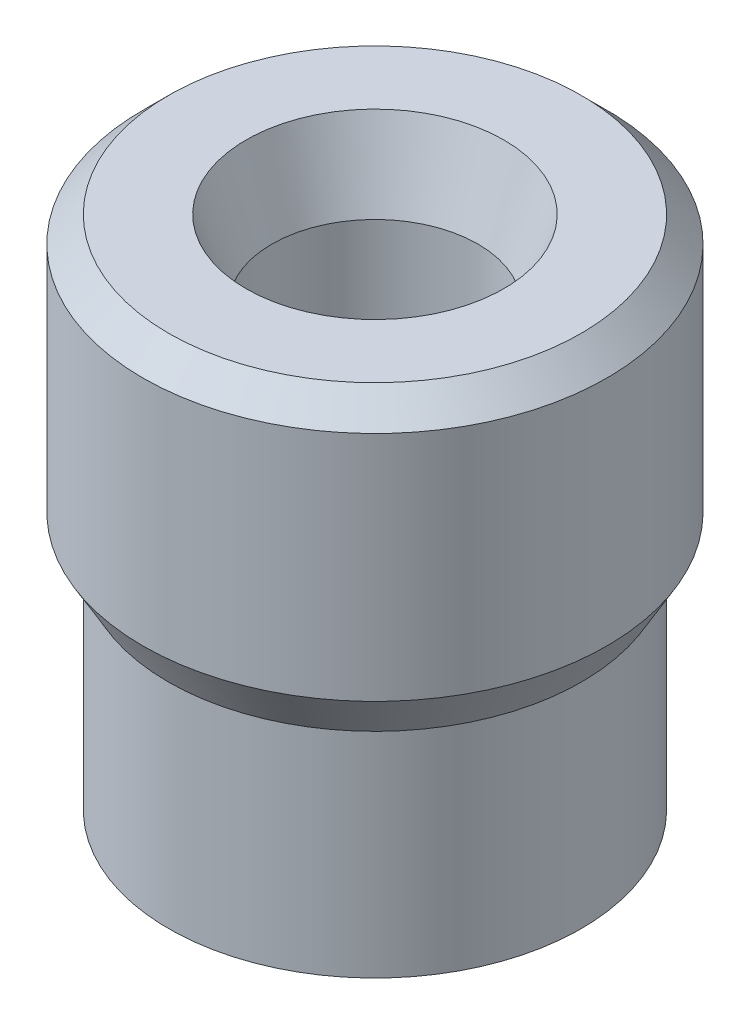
ISO-10303-21;
HEADER;
FILE_DESCRIPTION(('STEP AP214'),'2;1');
FILE_NAME('part.step','',(''),(''),'','','');
FILE_SCHEMA(('AUTOMOTIVE_DESIGN { 1 0 10303 214 1 1 1 1 }'));
ENDSEC;
DATA;
#1=APPLICATION_CONTEXT('core data for automotive mechanical design processes');
#2=APPLICATION_PROTOCOL_DEFINITION('international standard','automotive_design',2000,#1);
#3=PRODUCT_CONTEXT('',#1,'mechanical');
#4=PRODUCT('Part','Part','',(#3));
#5=PRODUCT_RELATED_PRODUCT_CATEGORY('part','',(#4));
#6=PRODUCT_DEFINITION_FORMATION('','',#4);
#7=PRODUCT_DEFINITION_CONTEXT('part definition',#1,'design');
#8=PRODUCT_DEFINITION('design','',#6,#7);
#9=PRODUCT_DEFINITION_SHAPE('','',#8);
#10=(LENGTH_UNIT() NAMED_UNIT(*) SI_UNIT(.MILLI.,.METRE.));
#11=(NAMED_UNIT(*) PLANE_ANGLE_UNIT() SI_UNIT($,.RADIAN.));
#12=(NAMED_UNIT(*) SI_UNIT($,.STERADIAN.) SOLID_ANGLE_UNIT());
#13=UNCERTAINTY_MEASURE_WITH_UNIT(LENGTH_MEASURE(1.E-05),#10,'distance_accuracy_value','');
#14=(GEOMETRIC_REPRESENTATION_CONTEXT(3) GLOBAL_UNCERTAINTY_ASSIGNED_CONTEXT((#13)) GLOBAL_UNIT_ASSIGNED_CONTEXT((#10,
#11,#12)) REPRESENTATION_CONTEXT('',''));
#15=CARTESIAN_POINT('',(0.,0.,0.));
#16=DIRECTION('',(0.,0.,1.));
#17=DIRECTION('',(1.,0.,0.));
#18=AXIS2_PLACEMENT_3D('',#15,#16,#17);
#19=CARTESIAN_POINT('',(0.,8.3,0.));
#20=DIRECTION('',(0.,-1.,0.));
#21=DIRECTION('',(0.,0.,-1.));
#22=AXIS2_PLACEMENT_3D('',#19,#20,#21);
#23=CYLINDRICAL_SURFACE('',#22,8.);
#24=CARTESIAN_POINT('',(0.,8.3,0.));
#25=DIRECTION('',(0.,1.,0.));
#26=DIRECTION('',(0.,0.,1.));
#27=AXIS2_PLACEMENT_3D('',#24,#25,#26);
#28=CIRCLE('',#27,8.);
#29=CARTESIAN_POINT('',(0.,8.3,-8.));
#30=VERTEX_POINT('',#29);
#31=EDGE_CURVE('E59',#30,#30,#28,.T.);
#32=CARTESIAN_POINT('',(0.,0.,0.));
#33=DIRECTION('',(0.,1.,0.));
#34=DIRECTION('',(0.,0.,1.));
#35=AXIS2_PLACEMENT_3D('',#32,#33,#34);
#36=CIRCLE('',#35,8.);
#37=CARTESIAN_POINT('',(0.,0.,-8.));
#38=VERTEX_POINT('',#37);
#39=EDGE_CURVE('E60',#38,#38,#36,.T.);
#40=CARTESIAN_POINT('',(0.,8.3,-8.));
#41=CARTESIAN_POINT('',(0.,8.21354166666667,-8.));
#42=CARTESIAN_POINT('',(0.,8.12708333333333,-8.));
#43=CARTESIAN_POINT('',(0.,7.95416666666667,-8.));
#44=CARTESIAN_POINT('',(0.,7.86770833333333,-8.));
#45=CARTESIAN_POINT('',(0.,7.69479166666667,-8.));
#46=CARTESIAN_POINT('',(0.,7.60833333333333,-8.));
#47=CARTESIAN_POINT('',(0.,7.43541666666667,-8.));
#48=CARTESIAN_POINT('',(0.,7.34895833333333,-8.));
#49=CARTESIAN_POINT('',(0.,7.17604166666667,-8.));
#50=CARTESIAN_POINT('',(0.,7.08958333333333,-8.));
#51=CARTESIAN_POINT('',(0.,6.91666666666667,-8.));
#52=CARTESIAN_POINT('',(0.,6.83020833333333,-8.));
#53=CARTESIAN_POINT('',(0.,6.65729166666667,-8.));
#54=CARTESIAN_POINT('',(0.,6.57083333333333,-8.));
#55=CARTESIAN_POINT('',(0.,6.39791666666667,-8.));
#56=CARTESIAN_POINT('',(0.,6.31145833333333,-8.));
#57=CARTESIAN_POINT('',(0.,6.13854166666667,-8.));
#58=CARTESIAN_POINT('',(0.,6.05208333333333,-8.));
#59=CARTESIAN_POINT('',(0.,5.87916666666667,-8.));
#60=CARTESIAN_POINT('',(0.,5.79270833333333,-8.));
#61=CARTESIAN_POINT('',(0.,5.61979166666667,-8.));
#62=CARTESIAN_POINT('',(0.,5.53333333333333,-8.));
#63=CARTESIAN_POINT('',(0.,5.36041666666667,-8.));
#64=CARTESIAN_POINT('',(0.,5.27395833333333,-8.));
#65=CARTESIAN_POINT('',(0.,5.10104166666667,-8.));
#66=CARTESIAN_POINT('',(0.,5.01458333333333,-8.));
#67=CARTESIAN_POINT('',(0.,4.84166666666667,-8.));
#68=CARTESIAN_POINT('',(0.,4.75520833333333,-8.));
#69=CARTESIAN_POINT('',(0.,4.58229166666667,-8.));
#70=CARTESIAN_POINT('',(0.,4.49583333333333,-8.));
#71=CARTESIAN_POINT('',(0.,4.32291666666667,-8.));
#72=CARTESIAN_POINT('',(0.,4.23645833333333,-8.));
#73=CARTESIAN_POINT('',(0.,4.06354166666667,-8.));
#74=CARTESIAN_POINT('',(0.,3.97708333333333,-8.));
#75=CARTESIAN_POINT('',(0.,3.80416666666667,-8.));
#76=CARTESIAN_POINT('',(0.,3.71770833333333,-8.));
#77=CARTESIAN_POINT('',(0.,3.54479166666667,-8.));
#78=CARTESIAN_POINT('',(0.,3.45833333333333,-8.));
#79=CARTESIAN_POINT('',(0.,3.28541666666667,-8.));
#80=CARTESIAN_POINT('',(0.,3.19895833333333,-8.));
#81=CARTESIAN_POINT('',(0.,3.02604166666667,-8.));
#82=CARTESIAN_POINT('',(0.,2.93958333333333,-8.));
#83=CARTESIAN_POINT('',(0.,2.76666666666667,-8.));
#84=CARTESIAN_POINT('',(0.,2.68020833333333,-8.));
#85=CARTESIAN_POINT('',(0.,2.50729166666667,-8.));
#86=CARTESIAN_POINT('',(0.,2.42083333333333,-8.));
#87=CARTESIAN_POINT('',(0.,2.24791666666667,-8.));
#88=CARTESIAN_POINT('',(0.,2.16145833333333,-8.));
#89=CARTESIAN_POINT('',(0.,1.98854166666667,-8.));
#90=CARTESIAN_POINT('',(0.,1.90208333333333,-8.));
#91=CARTESIAN_POINT('',(0.,1.72916666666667,-8.));
#92=CARTESIAN_POINT('',(0.,1.64270833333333,-8.));
#93=CARTESIAN_POINT('',(0.,1.46979166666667,-8.));
#94=CARTESIAN_POINT('',(0.,1.38333333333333,-8.));
#95=CARTESIAN_POINT('',(0.,1.21041666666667,-8.));
#96=CARTESIAN_POINT('',(0.,1.12395833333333,-8.));
#97=CARTESIAN_POINT('',(0.,0.951041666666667,-8.));
#98=CARTESIAN_POINT('',(0.,0.864583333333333,-8.));
#99=CARTESIAN_POINT('',(0.,0.691666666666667,-8.));
#100=CARTESIAN_POINT('',(0.,0.605208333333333,-8.));
#101=CARTESIAN_POINT('',(0.,0.432291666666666,-8.));
#102=CARTESIAN_POINT('',(0.,0.345833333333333,-8.));
#103=CARTESIAN_POINT('',(0.,0.172916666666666,-8.));
#104=CARTESIAN_POINT('',(0.,0.086458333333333,-8.));
#105=CARTESIAN_POINT('',(0.,0.,-8.));
#106=B_SPLINE_CURVE_WITH_KNOTS('',3,(#40,#41,#42,#43,#44,#45,#46,#47,#48,#49,#50,#51,#52,#53,
#54,#55,#56,#57,#58,#59,#60,#61,#62,#63,#64,#65,#66,#67,#68,#69,#70,#71,#72,#73,#74,#75,#76,#77,
#78,#79,#80,#81,#82,#83,#84,#85,#86,#87,#88,#89,#90,#91,#92,#93,#94,#95,#96,#97,#98,#99,#100,
#101,#102,#103,#104,#105),.UNSPECIFIED.,.F.,.F.,(4,2,2,2,2,2,2,2,2,2,2,2,2,2,2,2,2,2,2,2,2,2,2,
2,2,2,2,2,2,2,2,2,4),(0.,0.259374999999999,0.518749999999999,0.778124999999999,1.0375,1.296875,
1.55625,1.815625,2.075,2.334375,2.59375,2.853125,3.1125,3.371875,3.63125,3.890625,4.15,4.409375,
4.66875,4.928125,5.1875,5.446875,5.70625,5.965625,6.225,6.484375,6.74375,7.003125,7.2625,
7.521875,7.78125,8.040625,8.3),.UNSPECIFIED.);
#107=EDGE_CURVE('BSEAM33',#30,#38,#106,.T.);
#108=ORIENTED_EDGE('',*,*,#31,.F.);
#109=ORIENTED_EDGE('',*,*,#39,.T.);
#110=ORIENTED_EDGE('',*,*,#107,.T.);
#111=ORIENTED_EDGE('',*,*,#107,.F.);
#112=EDGE_LOOP('',(#108,#110,#109,#111));
#113=FACE_BOUND('',#112,.T.);
#114=ADVANCED_FACE('F33',(#113),#23,.T.);
#115=CARTESIAN_POINT('',(0.,0.,0.));
#116=DIRECTION('',(0.,1.,0.));
#117=DIRECTION('',(0.,0.,1.));
#118=AXIS2_PLACEMENT_3D('',#115,#116,#117);
#119=PLANE('',#118);
#120=CARTESIAN_POINT('',(0.,0.,0.));
#121=DIRECTION('',(0.,-1.,0.));
#122=DIRECTION('',(0.,0.,-1.));
#123=AXIS2_PLACEMENT_3D('',#120,#121,#122);
#124=CIRCLE('',#123,3.);
#125=CARTESIAN_POINT('',(0.,0.,-3.));
#126=VERTEX_POINT('',#125);
#127=EDGE_CURVE('E63',#126,#126,#124,.T.);
#128=ORIENTED_EDGE('',*,*,#127,.F.);
#129=EDGE_LOOP('',(#128));
#130=FACE_BOUND('',#129,.T.);
#131=ORIENTED_EDGE('',*,*,#39,.F.);
#132=EDGE_LOOP('',(#131));
#133=FACE_BOUND('',#132,.T.);
#134=ADVANCED_FACE('F90',(#130,#133),#119,.F.);
#135=CARTESIAN_POINT('',(0.,8.3,0.));
#136=DIRECTION('',(0.,1.,0.));
#137=DIRECTION('',(0.,0.,1.));
#138=AXIS2_PLACEMENT_3D('',#135,#136,#137);
#139=PLANE('',#138);
#140=CARTESIAN_POINT('',(0.,8.3,0.));
#141=DIRECTION('',(0.,1.,0.));
#142=DIRECTION('',(0.,0.,1.));
#143=AXIS2_PLACEMENT_3D('',#140,#141,#142);
#144=CIRCLE('',#143,8.01850454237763);
#145=CARTESIAN_POINT('',(0.,8.3,8.01850454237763));
#146=VERTEX_POINT('',#145);
#147=EDGE_CURVE('E53',#146,#146,#144,.F.);
#148=ORIENTED_EDGE('',*,*,#147,.T.);
#149=EDGE_LOOP('',(#148));
#150=FACE_BOUND('',#149,.T.);
#151=ORIENTED_EDGE('',*,*,#31,.T.);
#152=EDGE_LOOP('',(#151));
#153=FACE_BOUND('',#152,.T.);
#154=ADVANCED_FACE('F96',(#150,#153),#139,.F.);
#155=CARTESIAN_POINT('',(0.,20.,0.));
#156=DIRECTION('',(0.,-1.,0.));
#157=DIRECTION('',(0.,0.,-1.));
#158=AXIS2_PLACEMENT_3D('',#155,#156,#157);
#159=CYLINDRICAL_SURFACE('',#158,9.);
#160=CARTESIAN_POINT('',(0.,19.,0.));
#161=DIRECTION('',(0.,1.,0.));
#162=DIRECTION('',(0.,0.,1.));
#163=AXIS2_PLACEMENT_3D('',#160,#161,#162);
#164=CIRCLE('',#163,9.);
#165=CARTESIAN_POINT('',(0.,19.,9.));
#166=VERTEX_POINT('',#165);
#167=EDGE_CURVE('E44',#166,#166,#164,.F.);
#168=ORIENTED_EDGE('',*,*,#167,.T.);
#169=EDGE_LOOP('',(#168));
#170=FACE_BOUND('',#169,.T.);
#171=CARTESIAN_POINT('',(0.,10.,0.));
#172=DIRECTION('',(0.,1.,0.));
#173=DIRECTION('',(0.,0.,1.));
#174=AXIS2_PLACEMENT_3D('',#171,#172,#173);
#175=CIRCLE('',#174,9.);
#176=CARTESIAN_POINT('',(0.,10.,9.));
#177=VERTEX_POINT('',#176);
#178=EDGE_CURVE('E56',#177,#177,#175,.T.);
#179=ORIENTED_EDGE('',*,*,#178,.T.);
#180=EDGE_LOOP('',(#179));
#181=FACE_BOUND('',#180,.T.);
#182=ADVANCED_FACE('F119',(#170,#181),#159,.T.);
#183=CARTESIAN_POINT('',(0.,20.,0.));
#184=DIRECTION('',(0.,1.,0.));
#185=DIRECTION('',(0.,0.,1.));
#186=AXIS2_PLACEMENT_3D('',#183,#184,#185);
#187=PLANE('',#186);
#188=CARTESIAN_POINT('',(0.,20.,0.));
#189=DIRECTION('',(0.,1.,0.));
#190=DIRECTION('',(0.,0.,1.));
#191=AXIS2_PLACEMENT_3D('',#188,#189,#190);
#192=CIRCLE('',#191,5.);
#193=CARTESIAN_POINT('',(0.,20.,5.));
#194=VERTEX_POINT('',#193);
#195=EDGE_CURVE('E10',#194,#194,#192,.F.);
#196=ORIENTED_EDGE('',*,*,#195,.T.);
#197=EDGE_LOOP('',(#196));
#198=FACE_BOUND('',#197,.T.);
#199=CARTESIAN_POINT('',(0.,20.,0.));
#200=DIRECTION('',(0.,1.,0.));
#201=DIRECTION('',(0.,0.,1.));
#202=AXIS2_PLACEMENT_3D('',#199,#200,#201);
#203=CIRCLE('',#202,8.);
#204=CARTESIAN_POINT('',(0.,20.,8.));
#205=VERTEX_POINT('',#204);
#206=EDGE_CURVE('E48',#205,#205,#203,.T.);
#207=ORIENTED_EDGE('',*,*,#206,.T.);
#208=EDGE_LOOP('',(#207));
#209=FACE_BOUND('',#208,.T.);
#210=ADVANCED_FACE('F106',(#198,#209),#187,.T.);
#211=CARTESIAN_POINT('',(0.,10.,0.));
#212=DIRECTION('',(0.,1.,0.));
#213=DIRECTION('',(0.,0.,1.));
#214=AXIS2_PLACEMENT_3D('',#211,#212,#213);
#215=CONICAL_SURFACE('',#214,9.,0.523598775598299);
#216=ORIENTED_EDGE('',*,*,#147,.F.);
#217=EDGE_LOOP('',(#216));
#218=FACE_BOUND('',#217,.T.);
#219=ORIENTED_EDGE('',*,*,#178,.F.);
#220=EDGE_LOOP('',(#219));
#221=FACE_BOUND('',#220,.T.);
#222=ADVANCED_FACE('F103',(#218,#221),#215,.T.);
#223=CARTESIAN_POINT('',(0.,20.,0.));
#224=DIRECTION('',(0.,-1.,0.));
#225=DIRECTION('',(0.,0.,-1.));
#226=AXIS2_PLACEMENT_3D('',#223,#224,#225);
#227=CONICAL_SURFACE('',#226,8.,0.785398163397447);
#228=ORIENTED_EDGE('',*,*,#167,.F.);
#229=EDGE_LOOP('',(#228));
#230=FACE_BOUND('',#229,.T.);
#231=ORIENTED_EDGE('',*,*,#206,.F.);
#232=EDGE_LOOP('',(#231));
#233=FACE_BOUND('',#232,.T.);
#234=ADVANCED_FACE('F105',(#230,#233),#227,.T.);
#235=CARTESIAN_POINT('',(0.,11.,0.));
#236=DIRECTION('',(0.,-1.,0.));
#237=DIRECTION('',(0.,0.,-1.));
#238=AXIS2_PLACEMENT_3D('',#235,#236,#237);
#239=CYLINDRICAL_SURFACE('',#238,3.);
#240=CARTESIAN_POINT('',(0.,11.,0.));
#241=DIRECTION('',(0.,1.,0.));
#242=DIRECTION('',(0.,0.,1.));
#243=AXIS2_PLACEMENT_3D('',#240,#241,#242);
#244=CIRCLE('',#243,3.);
#245=CARTESIAN_POINT('',(0.,11.,3.));
#246=VERTEX_POINT('',#245);
#247=EDGE_CURVE('E68',#246,#246,#244,.F.);
#248=ORIENTED_EDGE('',*,*,#247,.F.);
#249=EDGE_LOOP('',(#248));
#250=FACE_BOUND('',#249,.T.);
#251=ORIENTED_EDGE('',*,*,#127,.T.);
#252=EDGE_LOOP('',(#251));
#253=FACE_BOUND('',#252,.T.);
#254=ADVANCED_FACE('F86',(#250,#253),#239,.F.);
#255=CARTESIAN_POINT('',(0.,11.,0.));
#256=DIRECTION('',(0.,1.,0.));
#257=DIRECTION('',(0.,0.,1.));
#258=AXIS2_PLACEMENT_3D('',#255,#256,#257);
#259=PLANE('',#258);
#260=CARTESIAN_POINT('',(0.,11.,0.));
#261=DIRECTION('',(0.,1.,0.));
#262=DIRECTION('',(0.,0.,1.));
#263=AXIS2_PLACEMENT_3D('',#260,#261,#262);
#264=CIRCLE('',#263,4.);
#265=CARTESIAN_POINT('',(0.,11.,4.));
#266=VERTEX_POINT('',#265);
#267=EDGE_CURVE('E71',#266,#266,#264,.T.);
#268=ORIENTED_EDGE('',*,*,#267,.T.);
#269=EDGE_LOOP('',(#268));
#270=FACE_BOUND('',#269,.T.);
#271=ORIENTED_EDGE('',*,*,#247,.T.);
#272=EDGE_LOOP('',(#271));
#273=FACE_BOUND('',#272,.T.);
#274=ADVANCED_FACE('F75',(#270,#273),#259,.T.);
#275=CARTESIAN_POINT('',(0.,11.,0.));
#276=DIRECTION('',(0.,1.,0.));
#277=DIRECTION('',(0.,0.,1.));
#278=AXIS2_PLACEMENT_3D('',#275,#276,#277);
#279=CYLINDRICAL_SURFACE('',#278,4.);
#280=CARTESIAN_POINT('',(0.,17.,0.));
#281=DIRECTION('',(0.,1.,0.));
#282=DIRECTION('',(0.,0.,1.));
#283=AXIS2_PLACEMENT_3D('',#280,#281,#282);
#284=CIRCLE('',#283,4.);
#285=CARTESIAN_POINT('',(0.,17.,4.));
#286=VERTEX_POINT('',#285);
#287=EDGE_CURVE('E40',#286,#286,#284,.T.);
#288=ORIENTED_EDGE('',*,*,#287,.T.);
#289=EDGE_LOOP('',(#288));
#290=FACE_BOUND('',#289,.T.);
#291=ORIENTED_EDGE('',*,*,#267,.F.);
#292=EDGE_LOOP('',(#291));
#293=FACE_BOUND('',#292,.T.);
#294=ADVANCED_FACE('F78',(#290,#293),#279,.F.);
#295=CARTESIAN_POINT('',(0.,17.,0.));
#296=DIRECTION('',(0.,1.,0.));
#297=DIRECTION('',(0.,0.,1.));
#298=AXIS2_PLACEMENT_3D('',#295,#296,#297);
#299=CONICAL_SURFACE('',#298,4.,0.321750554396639);
#300=CARTESIAN_POINT('',(0.,20.,5.));
#301=CARTESIAN_POINT('',(0.,19.96875,4.98958333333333));
#302=CARTESIAN_POINT('',(0.,19.9375,4.97916666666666));
#303=CARTESIAN_POINT('',(0.,19.875,4.95833333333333));
#304=CARTESIAN_POINT('',(0.,19.84375,4.94791666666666));
#305=CARTESIAN_POINT('',(0.,19.78125,4.92708333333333));
#306=CARTESIAN_POINT('',(0.,19.75,4.91666666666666));
#307=CARTESIAN_POINT('',(0.,19.6875,4.89583333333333));
#308=CARTESIAN_POINT('',(0.,19.65625,4.88541666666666));
#309=CARTESIAN_POINT('',(0.,19.59375,4.86458333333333));
#310=CARTESIAN_POINT('',(0.,19.5625,4.85416666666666));
#311=CARTESIAN_POINT('',(0.,19.5,4.83333333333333));
#312=CARTESIAN_POINT('',(0.,19.46875,4.82291666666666));
#313=CARTESIAN_POINT('',(0.,19.40625,4.80208333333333));
#314=CARTESIAN_POINT('',(0.,19.375,4.79166666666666));
#315=CARTESIAN_POINT('',(0.,19.3125,4.77083333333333));
#316=CARTESIAN_POINT('',(0.,19.28125,4.76041666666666));
#317=CARTESIAN_POINT('',(0.,19.21875,4.73958333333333));
#318=CARTESIAN_POINT('',(0.,19.1875,4.72916666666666));
#319=CARTESIAN_POINT('',(0.,19.125,4.70833333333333));
#320=CARTESIAN_POINT('',(0.,19.09375,4.69791666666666));
#321=CARTESIAN_POINT('',(0.,19.03125,4.67708333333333));
#322=CARTESIAN_POINT('',(0.,19.,4.66666666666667));
#323=CARTESIAN_POINT('',(0.,18.9375,4.64583333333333));
#324=CARTESIAN_POINT('',(0.,18.90625,4.63541666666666));
#325=CARTESIAN_POINT('',(0.,18.84375,4.61458333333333));
#326=CARTESIAN_POINT('',(0.,18.8125,4.60416666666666));
#327=CARTESIAN_POINT('',(0.,18.75,4.58333333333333));
#328=CARTESIAN_POINT('',(0.,18.71875,4.57291666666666));
#329=CARTESIAN_POINT('',(0.,18.65625,4.55208333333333));
#330=CARTESIAN_POINT('',(0.,18.625,4.54166666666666));
#331=CARTESIAN_POINT('',(0.,18.5625,4.52083333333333));
#332=CARTESIAN_POINT('',(0.,18.53125,4.51041666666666));
#333=CARTESIAN_POINT('',(0.,18.46875,4.48958333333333));
#334=CARTESIAN_POINT('',(0.,18.4375,4.47916666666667));
#335=CARTESIAN_POINT('',(0.,18.375,4.45833333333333));
#336=CARTESIAN_POINT('',(0.,18.34375,4.44791666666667));
#337=CARTESIAN_POINT('',(0.,18.28125,4.42708333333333));
#338=CARTESIAN_POINT('',(0.,18.25,4.41666666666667));
#339=CARTESIAN_POINT('',(0.,18.1875,4.39583333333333));
#340=CARTESIAN_POINT('',(0.,18.15625,4.38541666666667));
#341=CARTESIAN_POINT('',(0.,18.09375,4.36458333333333));
#342=CARTESIAN_POINT('',(0.,18.0625,4.35416666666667));
#343=CARTESIAN_POINT('',(0.,18.,4.33333333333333));
#344=CARTESIAN_POINT('',(0.,17.96875,4.32291666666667));
#345=CARTESIAN_POINT('',(0.,17.90625,4.30208333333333));
#346=CARTESIAN_POINT('',(0.,17.875,4.29166666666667));
#347=CARTESIAN_POINT('',(0.,17.8125,4.27083333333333));
#348=CARTESIAN_POINT('',(0.,17.78125,4.26041666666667));
#349=CARTESIAN_POINT('',(0.,17.71875,4.23958333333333));
#350=CARTESIAN_POINT('',(0.,17.6875,4.22916666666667));
#351=CARTESIAN_POINT('',(0.,17.625,4.20833333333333));
#352=CARTESIAN_POINT('',(0.,17.59375,4.19791666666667));
#353=CARTESIAN_POINT('',(0.,17.53125,4.17708333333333));
#354=CARTESIAN_POINT('',(0.,17.5,4.16666666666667));
#355=CARTESIAN_POINT('',(0.,17.4375,4.14583333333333));
#356=CARTESIAN_POINT('',(0.,17.40625,4.13541666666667));
#357=CARTESIAN_POINT('',(0.,17.34375,4.11458333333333));
#358=CARTESIAN_POINT('',(0.,17.3125,4.10416666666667));
#359=CARTESIAN_POINT('',(0.,17.25,4.08333333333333));
#360=CARTESIAN_POINT('',(0.,17.21875,4.07291666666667));
#361=CARTESIAN_POINT('',(0.,17.15625,4.05208333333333));
#362=CARTESIAN_POINT('',(0.,17.125,4.04166666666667));
#363=CARTESIAN_POINT('',(0.,17.0625,4.02083333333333));
#364=CARTESIAN_POINT('',(0.,17.03125,4.01041666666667));
#365=CARTESIAN_POINT('',(0.,17.,4.));
#366=B_SPLINE_CURVE_WITH_KNOTS('',3,(#300,#301,#302,#303,#304,#305,#306,#307,#308,#309,#310,
#311,#312,#313,#314,#315,#316,#317,#318,#319,#320,#321,#322,#323,#324,#325,#326,#327,#328,#329,
#330,#331,#332,#333,#334,#335,#336,#337,#338,#339,#340,#341,#342,#343,#344,#345,#346,#347,#348,
#349,#350,#351,#352,#353,#354,#355,#356,#357,#358,#359,#360,#361,#362,#363,#364,#365),
.UNSPECIFIED.,.F.,.F.,(4,2,2,2,2,2,2,2,2,2,2,2,2,2,2,2,2,2,2,2,2,2,2,2,2,2,2,2,2,2,2,2,4),(0.,
0.0988211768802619,0.197642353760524,0.296463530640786,0.395284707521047,0.494105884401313,
0.592927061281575,0.691748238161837,0.790569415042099,0.889390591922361,0.988211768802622,
1.08703294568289,1.18585412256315,1.28467529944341,1.38349647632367,1.48231765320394,
1.5811388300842,1.67996000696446,1.77878118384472,1.87760236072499,1.97642353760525,
2.07524471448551,2.17406589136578,2.27288706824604,2.3717082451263,2.47052942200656,
2.56935059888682,2.66817177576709,2.76699295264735,2.86581412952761,2.96463530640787,
3.06345648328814,3.1622776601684),.UNSPECIFIED.);
#367=EDGE_CURVE('BSEAM35',#194,#286,#366,.T.);
#368=ORIENTED_EDGE('',*,*,#195,.F.);
#369=ORIENTED_EDGE('',*,*,#287,.F.);
#370=ORIENTED_EDGE('',*,*,#367,.T.);
#371=ORIENTED_EDGE('',*,*,#367,.F.);
#372=EDGE_LOOP('',(#368,#370,#369,#371));
#373=FACE_BOUND('',#372,.T.);
#374=ADVANCED_FACE('F35',(#373),#299,.F.);
#375=CLOSED_SHELL('',(#114,#134,#154,#182,#210,#222,#234,#254,#274,#294,#374));
#376=MANIFOLD_SOLID_BREP('B2',#375);
#377=ADVANCED_BREP_SHAPE_REPRESENTATION('',(#18,#376),#14);
#378=SHAPE_DEFINITION_REPRESENTATION(#9,#377);
ENDSEC;
END-ISO-10303-21;
